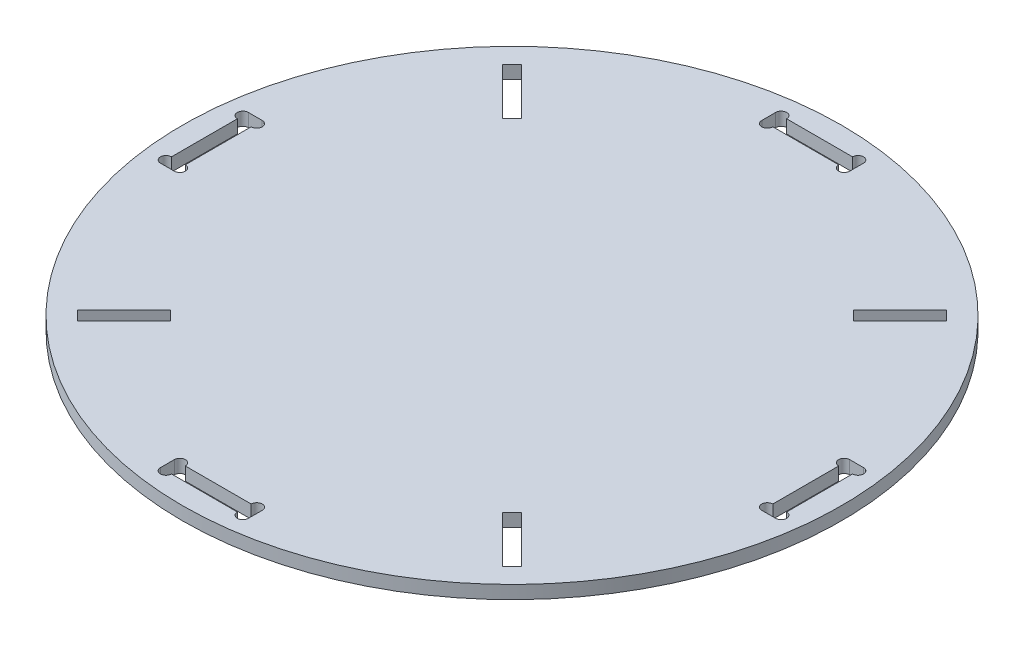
from build123d import *

# Parameters (mm, degrees)
SKETCH1_R           = 300
BOSS_EXTRUDE2_DEPTH = 12
CUT_EXTRUDE1_DEPTH  = 425.433740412
CUT_EXTRUDE2_DEPTH  = 425.433740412


with BuildPart() as part:
    # Sketch1 → Boss-Extrude2 (new body)
    with BuildSketch(Plane(origin=(0, 0, 0), x_dir=(1, 0, 0), z_dir=(0, 1, 0))):
        with Locations(Location((0, 0, 0), (0, 0, 270))):
            Circle(SKETCH1_R)
    extrude(amount=BOSS_EXTRUDE2_DEPTH)

    # Sketch3 → Cut-Extrude1 (cut, through all)
    with BuildSketch(Plane(origin=(0, 12, 0), x_dir=(1, 0, 0), z_dir=(0, 1, 0))):
        with BuildLine():
            Line((-30, 280), (30, 280))
            ThreePointArc((30, 280), (34.999806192, 285.044023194), (39.999612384, 280))
            Line((39.999612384, 280), (39.999612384, 267.4))
            ThreePointArc((39.999612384, 267.4), (34.999806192, 262.355976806), (30, 267.4))
            Line((30, 267.4), (-30, 267.4))
            ThreePointArc((-30, 267.4), (-34.999806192, 262.355976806), (-39.999612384, 267.4))
            Line((-39.999612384, 267.4), (-39.999612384, 280))
            ThreePointArc((-39.999612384, 280), (-34.999806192, 285.044023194), (-30, 280))
        make_face()
        with BuildLine():
            Line((280, 39.999612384), (267.4, 39.999612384))
            ThreePointArc((267.4, 39.999612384), (262.355976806, 34.999806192), (267.4, 30))
            Line((267.4, 30), (267.4, -30))
            ThreePointArc((267.4, -30), (262.355976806, -34.999806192), (267.4, -39.999612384))
            Line((267.4, -39.999612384), (280, -39.999612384))
            ThreePointArc((280, -39.999612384), (285.044023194, -34.999806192), (280, -30))
            Line((280, -30), (280, 30))
            ThreePointArc((280, 30), (285.044023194, 34.999806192), (280, 39.999612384))
        make_face()
        with BuildLine():
            Line((39.999612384, -280), (39.999612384, -267.4))
            ThreePointArc((39.999612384, -267.4), (34.999806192, -262.355976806), (30, -267.4))
            Line((30, -267.4), (-30, -267.4))
            ThreePointArc((-30, -267.4), (-34.999806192, -262.355976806), (-39.999612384, -267.4))
            Line((-39.999612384, -267.4), (-39.999612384, -280))
            ThreePointArc((-39.999612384, -280), (-34.999806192, -285.044023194), (-30, -280))
            Line((-30, -280), (30, -280))
            ThreePointArc((30, -280), (34.999806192, -285.044023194), (39.999612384, -280))
        make_face()
        with BuildLine():
            Line((-280, -39.999612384), (-267.4, -39.999612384))
            ThreePointArc((-267.4, -39.999612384), (-262.355976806, -34.999806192), (-267.4, -30))
            Line((-267.4, -30), (-267.4, 30))
            ThreePointArc((-267.4, 30), (-262.355976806, 34.999806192), (-267.4, 39.999612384))
            Line((-267.4, 39.999612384), (-280, 39.999612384))
            ThreePointArc((-280, 39.999612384), (-285.044023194, 34.999806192), (-280, 30))
            Line((-280, 30), (-280, -30))
            ThreePointArc((-280, -30), (-285.044023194, -34.999806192), (-280, -39.999612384))
        make_face()
    extrude(amount=-CUT_EXTRUDE1_DEPTH, mode=Mode.SUBTRACT)

    # Sketch4 → Cut-Extrude2 (cut, through all)
    with BuildSketch(Plane(origin=(0, 12, 0), x_dir=(1, 0, 0), z_dir=(0, 1, 0))):
        Polygon((193.406669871, 202.245504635), (202.245504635, 193.406669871), (159.819097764, 150.980262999), (150.980262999, 159.819097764), align=None)
        Polygon((-159.819097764, -150.980262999), (-202.245504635, -193.406669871), (-193.406669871, -202.245504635), (-150.980262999, -159.819097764), align=None)
        Polygon((202.245504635, -193.406669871), (193.406669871, -202.245504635), (150.980262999, -159.819097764), (159.819097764, -150.980262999), align=None)
        Polygon((-202.245504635, 193.406669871), (-193.406669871, 202.245504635), (-150.980262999, 159.819097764), (-159.819097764, 150.980262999), align=None)
    extrude(amount=-CUT_EXTRUDE2_DEPTH, mode=Mode.SUBTRACT)


solid = part.part
